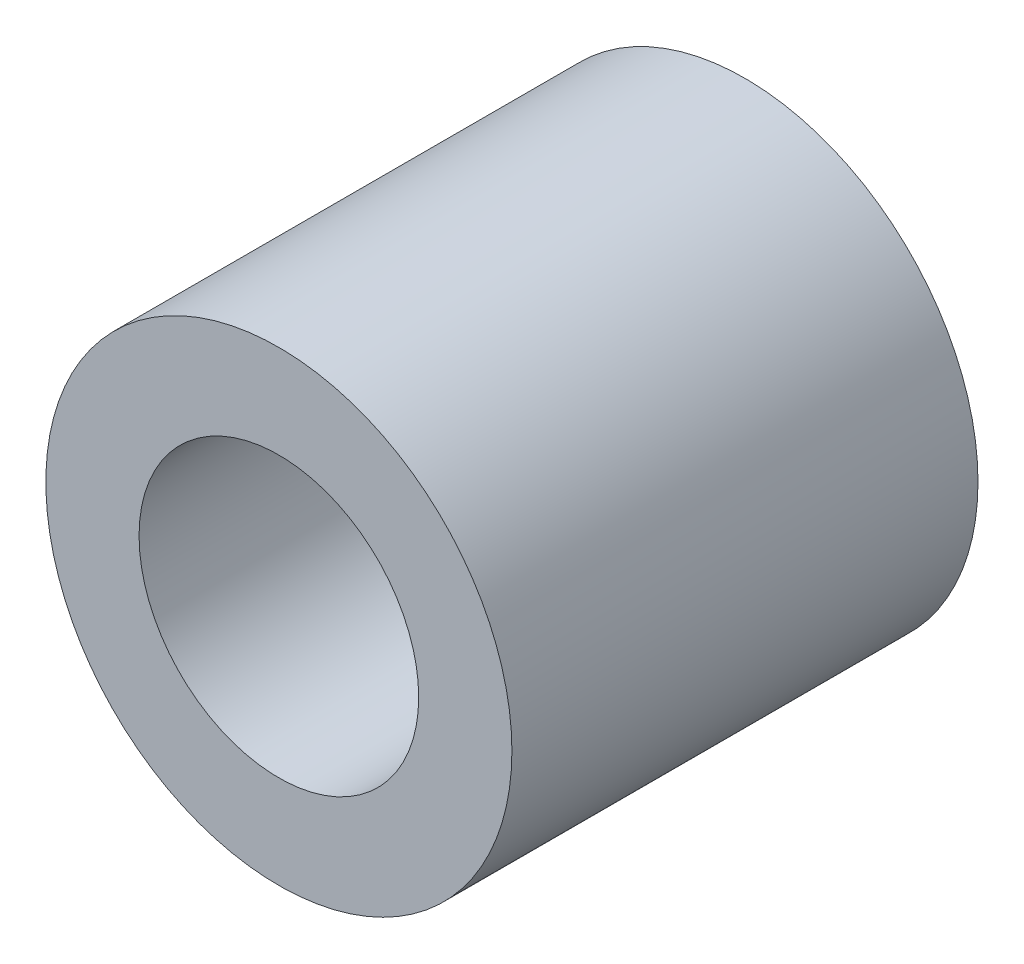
from build123d import *

# Parameters (mm, degrees)
SKETCH1_R           = 5
SKETCH1_R_2         = 3
BOSS_EXTRUDE1_DEPTH = 5


with BuildPart() as part:
    # Sketch1 → Boss-Extrude1 (new, symmetric)
    with BuildSketch(Plane.XY):
        Circle(SKETCH1_R)
        Circle(SKETCH1_R_2, mode=Mode.SUBTRACT)
    extrude(amount=BOSS_EXTRUDE1_DEPTH, both=True)


solid = part.part
